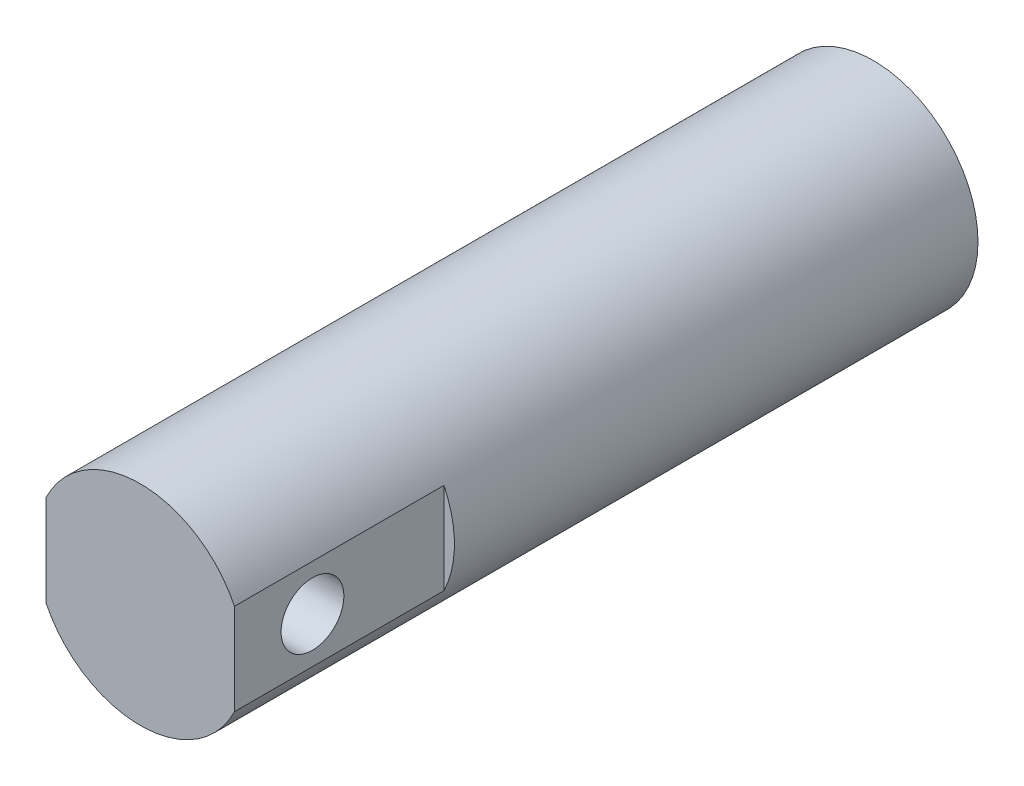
ISO-10303-21;
HEADER;
FILE_DESCRIPTION(('STEP AP214'),'2;1');
FILE_NAME('part.step','',(''),(''),'','','');
FILE_SCHEMA(('AUTOMOTIVE_DESIGN { 1 0 10303 214 1 1 1 1 }'));
ENDSEC;
DATA;
#1=APPLICATION_CONTEXT('core data for automotive mechanical design processes');
#2=APPLICATION_PROTOCOL_DEFINITION('international standard','automotive_design',2000,#1);
#3=PRODUCT_CONTEXT('',#1,'mechanical');
#4=PRODUCT('Part','Part','',(#3));
#5=PRODUCT_RELATED_PRODUCT_CATEGORY('part','',(#4));
#6=PRODUCT_DEFINITION_FORMATION('','',#4);
#7=PRODUCT_DEFINITION_CONTEXT('part definition',#1,'design');
#8=PRODUCT_DEFINITION('design','',#6,#7);
#9=PRODUCT_DEFINITION_SHAPE('','',#8);
#10=(LENGTH_UNIT() NAMED_UNIT(*) SI_UNIT(.MILLI.,.METRE.));
#11=(NAMED_UNIT(*) PLANE_ANGLE_UNIT() SI_UNIT($,.RADIAN.));
#12=(NAMED_UNIT(*) SI_UNIT($,.STERADIAN.) SOLID_ANGLE_UNIT());
#13=UNCERTAINTY_MEASURE_WITH_UNIT(LENGTH_MEASURE(1.E-05),#10,'distance_accuracy_value','');
#14=(GEOMETRIC_REPRESENTATION_CONTEXT(3) GLOBAL_UNCERTAINTY_ASSIGNED_CONTEXT((#13)) GLOBAL_UNIT_ASSIGNED_CONTEXT((#10,
#11,#12)) REPRESENTATION_CONTEXT('',''));
#15=CARTESIAN_POINT('',(0.,0.,0.));
#16=DIRECTION('',(0.,0.,1.));
#17=DIRECTION('',(1.,0.,0.));
#18=AXIS2_PLACEMENT_3D('',#15,#16,#17);
#19=CARTESIAN_POINT('',(0.,0.,35.));
#20=DIRECTION('',(0.,0.,-1.));
#21=DIRECTION('',(-1.,0.,0.));
#22=AXIS2_PLACEMENT_3D('',#19,#20,#21);
#23=CYLINDRICAL_SURFACE('',#22,5.);
#24=CARTESIAN_POINT('',(0.,0.,0.));
#25=DIRECTION('',(0.,0.,1.));
#26=DIRECTION('',(1.,0.,0.));
#27=AXIS2_PLACEMENT_3D('',#24,#25,#26);
#28=CIRCLE('',#27,5.);
#29=CARTESIAN_POINT('',(5.,0.,0.));
#30=VERTEX_POINT('',#29);
#31=EDGE_CURVE('E106',#30,#30,#28,.T.);
#32=ORIENTED_EDGE('',*,*,#31,.T.);
#33=EDGE_LOOP('',(#32));
#34=FACE_BOUND('',#33,.T.);
#35=DIRECTION('',(0.,0.,-1.));
#36=VECTOR('',#35,1.);
#37=CARTESIAN_POINT('',(4.5,-2.17944947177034,35.));
#38=LINE('',#37,#36);
#39=CARTESIAN_POINT('',(4.5,-2.17944947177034,35.));
#40=VERTEX_POINT('',#39);
#41=CARTESIAN_POINT('',(4.5,-2.17944947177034,25.));
#42=VERTEX_POINT('',#41);
#43=EDGE_CURVE('E109',#40,#42,#38,.T.);
#44=ORIENTED_EDGE('',*,*,#43,.F.);
#45=CARTESIAN_POINT('',(0.,0.,35.));
#46=DIRECTION('',(0.,0.,1.));
#47=DIRECTION('',(1.,0.,0.));
#48=AXIS2_PLACEMENT_3D('',#45,#46,#47);
#49=CIRCLE('',#48,5.);
#50=CARTESIAN_POINT('',(-4.5,-2.17944947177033,35.));
#51=VERTEX_POINT('',#50);
#52=EDGE_CURVE('E102',#51,#40,#49,.T.);
#53=ORIENTED_EDGE('',*,*,#52,.F.);
#54=DIRECTION('',(0.,0.,-1.));
#55=VECTOR('',#54,1.);
#56=CARTESIAN_POINT('',(-4.5,-2.17944947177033,35.));
#57=LINE('',#56,#55);
#58=CARTESIAN_POINT('',(-4.5,-2.17944947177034,25.));
#59=VERTEX_POINT('',#58);
#60=EDGE_CURVE('E55',#59,#51,#57,.F.);
#61=ORIENTED_EDGE('',*,*,#60,.F.);
#62=CARTESIAN_POINT('',(0.,0.,25.));
#63=DIRECTION('',(0.,0.,1.));
#64=DIRECTION('',(1.,0.,0.));
#65=AXIS2_PLACEMENT_3D('',#62,#63,#64);
#66=CIRCLE('',#65,5.);
#67=CARTESIAN_POINT('',(-4.5,2.17944947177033,25.));
#68=VERTEX_POINT('',#67);
#69=EDGE_CURVE('E43',#68,#59,#66,.T.);
#70=ORIENTED_EDGE('',*,*,#69,.F.);
#71=DIRECTION('',(0.,0.,-1.));
#72=VECTOR('',#71,1.);
#73=CARTESIAN_POINT('',(-4.5,2.17944947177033,35.));
#74=LINE('',#73,#72);
#75=CARTESIAN_POINT('',(-4.5,2.17944947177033,35.));
#76=VERTEX_POINT('',#75);
#77=EDGE_CURVE('E82',#76,#68,#74,.T.);
#78=ORIENTED_EDGE('',*,*,#77,.F.);
#79=CARTESIAN_POINT('',(4.5,2.17944947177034,35.));
#80=VERTEX_POINT('',#79);
#81=EDGE_CURVE('E96',#80,#76,#49,.T.);
#82=ORIENTED_EDGE('',*,*,#81,.F.);
#83=DIRECTION('',(0.,0.,-1.));
#84=VECTOR('',#83,1.);
#85=CARTESIAN_POINT('',(4.5,2.17944947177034,35.));
#86=LINE('',#85,#84);
#87=CARTESIAN_POINT('',(4.5,2.17944947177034,25.));
#88=VERTEX_POINT('',#87);
#89=EDGE_CURVE('E63',#88,#80,#86,.F.);
#90=ORIENTED_EDGE('',*,*,#89,.F.);
#91=EDGE_CURVE('E12',#42,#88,#66,.T.);
#92=ORIENTED_EDGE('',*,*,#91,.F.);
#93=EDGE_LOOP('',(#44,#53,#61,#70,#78,#82,#90,#92));
#94=FACE_BOUND('',#93,.T.);
#95=ADVANCED_FACE('F40',(#34,#94),#23,.T.);
#96=CARTESIAN_POINT('',(0.,0.,35.));
#97=DIRECTION('',(0.,0.,1.));
#98=DIRECTION('',(1.,0.,0.));
#99=AXIS2_PLACEMENT_3D('',#96,#97,#98);
#100=PLANE('',#99);
#101=ORIENTED_EDGE('',*,*,#52,.T.);
#102=DIRECTION('',(0.,1.,0.));
#103=VECTOR('',#102,1.);
#104=CARTESIAN_POINT('',(4.5,-5.16989428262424,35.));
#105=LINE('',#104,#103);
#106=EDGE_CURVE('E90',#40,#80,#105,.T.);
#107=ORIENTED_EDGE('',*,*,#106,.T.);
#108=ORIENTED_EDGE('',*,*,#81,.T.);
#109=DIRECTION('',(0.,-1.,0.));
#110=VECTOR('',#109,1.);
#111=CARTESIAN_POINT('',(-4.5,-5.16989428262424,35.));
#112=LINE('',#111,#110);
#113=EDGE_CURVE('E79',#76,#51,#112,.T.);
#114=ORIENTED_EDGE('',*,*,#113,.T.);
#115=EDGE_LOOP('',(#101,#107,#108,#114));
#116=FACE_BOUND('',#115,.T.);
#117=ADVANCED_FACE('F100',(#116),#100,.T.);
#118=CARTESIAN_POINT('',(0.,0.,0.));
#119=DIRECTION('',(0.,0.,1.));
#120=DIRECTION('',(1.,0.,0.));
#121=AXIS2_PLACEMENT_3D('',#118,#119,#120);
#122=PLANE('',#121);
#123=ORIENTED_EDGE('',*,*,#31,.F.);
#124=EDGE_LOOP('',(#123));
#125=FACE_BOUND('',#124,.T.);
#126=ADVANCED_FACE('F153',(#125),#122,.F.);
#127=CARTESIAN_POINT('',(-4.5,-5.16989428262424,25.));
#128=DIRECTION('',(-1.,0.,0.));
#129=DIRECTION('',(0.,0.,1.));
#130=AXIS2_PLACEMENT_3D('',#127,#128,#129);
#131=PLANE('',#130);
#132=CARTESIAN_POINT('',(-4.5,0.,31.2770243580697));
#133=DIRECTION('',(-1.,0.,0.));
#134=DIRECTION('',(0.,0.,1.));
#135=AXIS2_PLACEMENT_3D('',#132,#133,#134);
#136=CIRCLE('',#135,1.5);
#137=CARTESIAN_POINT('',(-4.5,0.,32.7770243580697));
#138=VERTEX_POINT('',#137);
#139=EDGE_CURVE('E114',#138,#138,#136,.F.);
#140=ORIENTED_EDGE('',*,*,#139,.T.);
#141=EDGE_LOOP('',(#140));
#142=FACE_BOUND('',#141,.T.);
#143=ORIENTED_EDGE('',*,*,#77,.T.);
#144=DIRECTION('',(0.,-1.,0.));
#145=VECTOR('',#144,1.);
#146=CARTESIAN_POINT('',(-4.5,-5.16989428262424,25.));
#147=LINE('',#146,#145);
#148=EDGE_CURVE('E117',#68,#59,#147,.T.);
#149=ORIENTED_EDGE('',*,*,#148,.T.);
#150=ORIENTED_EDGE('',*,*,#60,.T.);
#151=ORIENTED_EDGE('',*,*,#113,.F.);
#152=EDGE_LOOP('',(#143,#149,#150,#151));
#153=FACE_BOUND('',#152,.T.);
#154=ADVANCED_FACE('F81',(#142,#153),#131,.T.);
#155=CARTESIAN_POINT('',(0.,0.,25.));
#156=DIRECTION('',(0.,0.,1.));
#157=DIRECTION('',(1.,0.,0.));
#158=AXIS2_PLACEMENT_3D('',#155,#156,#157);
#159=PLANE('',#158);
#160=ORIENTED_EDGE('',*,*,#69,.T.);
#161=ORIENTED_EDGE('',*,*,#148,.F.);
#162=EDGE_LOOP('',(#160,#161));
#163=FACE_BOUND('',#162,.T.);
#164=ADVANCED_FACE('F138',(#163),#159,.T.);
#165=ORIENTED_EDGE('',*,*,#91,.T.);
#166=DIRECTION('',(0.,1.,0.));
#167=VECTOR('',#166,1.);
#168=CARTESIAN_POINT('',(4.5,-5.16989428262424,25.));
#169=LINE('',#168,#167);
#170=EDGE_CURVE('E89',#42,#88,#169,.T.);
#171=ORIENTED_EDGE('',*,*,#170,.F.);
#172=EDGE_LOOP('',(#165,#171));
#173=FACE_BOUND('',#172,.T.);
#174=ADVANCED_FACE('F136',(#173),#159,.T.);
#175=CARTESIAN_POINT('',(4.5,-5.16989428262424,25.));
#176=DIRECTION('',(1.,0.,0.));
#177=DIRECTION('',(0.,0.,-1.));
#178=AXIS2_PLACEMENT_3D('',#175,#176,#177);
#179=PLANE('',#178);
#180=CARTESIAN_POINT('',(4.5,0.,31.2770243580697));
#181=DIRECTION('',(1.,0.,0.));
#182=DIRECTION('',(0.,0.,-1.));
#183=AXIS2_PLACEMENT_3D('',#180,#181,#182);
#184=CIRCLE('',#183,1.5);
#185=CARTESIAN_POINT('',(4.5,0.,29.7770243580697));
#186=VERTEX_POINT('',#185);
#187=EDGE_CURVE('E98',#186,#186,#184,.F.);
#188=ORIENTED_EDGE('',*,*,#187,.T.);
#189=EDGE_LOOP('',(#188));
#190=FACE_BOUND('',#189,.T.);
#191=ORIENTED_EDGE('',*,*,#43,.T.);
#192=ORIENTED_EDGE('',*,*,#170,.T.);
#193=ORIENTED_EDGE('',*,*,#89,.T.);
#194=ORIENTED_EDGE('',*,*,#106,.F.);
#195=EDGE_LOOP('',(#191,#192,#193,#194));
#196=FACE_BOUND('',#195,.T.);
#197=ADVANCED_FACE('F133',(#190,#196),#179,.T.);
#198=CARTESIAN_POINT('',(-5.,0.,31.2770243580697));
#199=DIRECTION('',(1.,0.,0.));
#200=DIRECTION('',(0.,0.,-1.));
#201=AXIS2_PLACEMENT_3D('',#198,#199,#200);
#202=CYLINDRICAL_SURFACE('',#201,1.5);
#203=ORIENTED_EDGE('',*,*,#139,.F.);
#204=EDGE_LOOP('',(#203));
#205=FACE_BOUND('',#204,.T.);
#206=ORIENTED_EDGE('',*,*,#187,.F.);
#207=EDGE_LOOP('',(#206));
#208=FACE_BOUND('',#207,.T.);
#209=ADVANCED_FACE('F144',(#205,#208),#202,.F.);
#210=CLOSED_SHELL('',(#95,#117,#126,#154,#164,#174,#197,#209));
#211=MANIFOLD_SOLID_BREP('B2',#210);
#212=ADVANCED_BREP_SHAPE_REPRESENTATION('',(#18,#211),#14);
#213=SHAPE_DEFINITION_REPRESENTATION(#9,#212);
ENDSEC;
END-ISO-10303-21;
